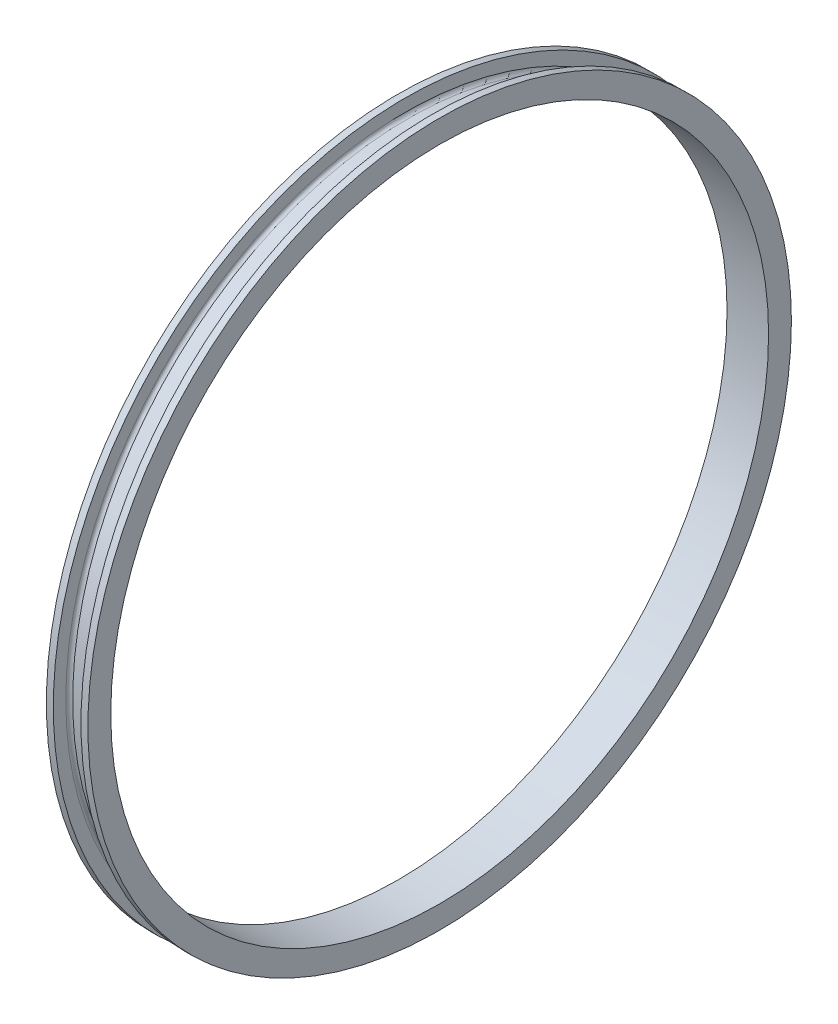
ISO-10303-21;
HEADER;
FILE_DESCRIPTION(('STEP AP214'),'2;1');
FILE_NAME('part.step','',(''),(''),'','','');
FILE_SCHEMA(('AUTOMOTIVE_DESIGN { 1 0 10303 214 1 1 1 1 }'));
ENDSEC;
DATA;
#1=APPLICATION_CONTEXT('core data for automotive mechanical design processes');
#2=APPLICATION_PROTOCOL_DEFINITION('international standard','automotive_design',2000,#1);
#3=PRODUCT_CONTEXT('',#1,'mechanical');
#4=PRODUCT('Part','Part','',(#3));
#5=PRODUCT_RELATED_PRODUCT_CATEGORY('part','',(#4));
#6=PRODUCT_DEFINITION_FORMATION('','',#4);
#7=PRODUCT_DEFINITION_CONTEXT('part definition',#1,'design');
#8=PRODUCT_DEFINITION('design','',#6,#7);
#9=PRODUCT_DEFINITION_SHAPE('','',#8);
#10=(LENGTH_UNIT() NAMED_UNIT(*) SI_UNIT(.MILLI.,.METRE.));
#11=(NAMED_UNIT(*) PLANE_ANGLE_UNIT() SI_UNIT($,.RADIAN.));
#12=(NAMED_UNIT(*) SI_UNIT($,.STERADIAN.) SOLID_ANGLE_UNIT());
#13=UNCERTAINTY_MEASURE_WITH_UNIT(LENGTH_MEASURE(1.E-05),#10,'distance_accuracy_value','');
#14=(GEOMETRIC_REPRESENTATION_CONTEXT(3) GLOBAL_UNCERTAINTY_ASSIGNED_CONTEXT((#13)) GLOBAL_UNIT_ASSIGNED_CONTEXT((#10,
#11,#12)) REPRESENTATION_CONTEXT('',''));
#15=CARTESIAN_POINT('',(0.,0.,0.));
#16=DIRECTION('',(0.,0.,1.));
#17=DIRECTION('',(1.,0.,0.));
#18=AXIS2_PLACEMENT_3D('',#15,#16,#17);
#19=CARTESIAN_POINT('',(0.,0.,0.));
#20=DIRECTION('',(1.,0.,0.));
#21=DIRECTION('',(0.,0.,-1.));
#22=AXIS2_PLACEMENT_3D('',#19,#20,#21);
#23=CYLINDRICAL_SURFACE('',#22,50.8);
#24=CARTESIAN_POINT('',(-75.8170233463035,0.,0.));
#25=DIRECTION('',(1.,0.,0.));
#26=DIRECTION('',(0.,0.,-1.));
#27=AXIS2_PLACEMENT_3D('',#24,#25,#26);
#28=CIRCLE('',#27,50.8);
#29=CARTESIAN_POINT('',(-75.8170233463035,0.,-50.8));
#30=VERTEX_POINT('',#29);
#31=EDGE_CURVE('E64',#30,#30,#28,.T.);
#32=ORIENTED_EDGE('',*,*,#31,.T.);
#33=EDGE_LOOP('',(#32));
#34=FACE_BOUND('',#33,.T.);
#35=CARTESIAN_POINT('',(-74.8170233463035,0.,0.));
#36=DIRECTION('',(1.,0.,0.));
#37=DIRECTION('',(0.,0.,-1.));
#38=AXIS2_PLACEMENT_3D('',#35,#36,#37);
#39=CIRCLE('',#38,50.8);
#40=CARTESIAN_POINT('',(-74.8170233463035,0.,-50.8));
#41=VERTEX_POINT('',#40);
#42=EDGE_CURVE('E10',#41,#41,#39,.T.);
#43=ORIENTED_EDGE('',*,*,#42,.F.);
#44=EDGE_LOOP('',(#43));
#45=FACE_BOUND('',#44,.T.);
#46=ADVANCED_FACE('F30',(#34,#45),#23,.T.);
#47=CARTESIAN_POINT('',(-74.8170233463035,49.,0.));
#48=DIRECTION('',(1.,0.,0.));
#49=DIRECTION('',(0.,0.,-1.));
#50=AXIS2_PLACEMENT_3D('',#47,#48,#49);
#51=PLANE('',#50);
#52=ORIENTED_EDGE('',*,*,#42,.T.);
#53=EDGE_LOOP('',(#52));
#54=FACE_BOUND('',#53,.T.);
#55=CARTESIAN_POINT('',(-74.8170233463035,0.,0.));
#56=DIRECTION('',(1.,0.,0.));
#57=DIRECTION('',(0.,0.,-1.));
#58=AXIS2_PLACEMENT_3D('',#55,#56,#57);
#59=CIRCLE('',#58,49.);
#60=CARTESIAN_POINT('',(-74.8170233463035,0.,-49.));
#61=VERTEX_POINT('',#60);
#62=EDGE_CURVE('E36',#61,#61,#59,.T.);
#63=ORIENTED_EDGE('',*,*,#62,.F.);
#64=EDGE_LOOP('',(#63));
#65=FACE_BOUND('',#64,.T.);
#66=ADVANCED_FACE('F82',(#54,#65),#51,.T.);
#67=CARTESIAN_POINT('',(-74.3170233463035,0.,0.));
#68=DIRECTION('',(1.,0.,0.));
#69=DIRECTION('',(0.,0.,-1.));
#70=AXIS2_PLACEMENT_3D('',#67,#68,#69);
#71=TOROIDAL_SURFACE('',#70,49.,0.500000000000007);
#72=ORIENTED_EDGE('',*,*,#62,.T.);
#73=EDGE_LOOP('',(#72));
#74=FACE_BOUND('',#73,.T.);
#75=CARTESIAN_POINT('',(-74.3170233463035,0.,0.));
#76=DIRECTION('',(1.,0.,0.));
#77=DIRECTION('',(0.,0.,-1.));
#78=AXIS2_PLACEMENT_3D('',#75,#76,#77);
#79=CIRCLE('',#78,48.5);
#80=CARTESIAN_POINT('',(-74.3170233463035,0.,-48.5));
#81=VERTEX_POINT('',#80);
#82=EDGE_CURVE('E40',#81,#81,#79,.T.);
#83=ORIENTED_EDGE('',*,*,#82,.F.);
#84=EDGE_LOOP('',(#83));
#85=FACE_BOUND('',#84,.T.);
#86=ADVANCED_FACE('F86',(#74,#85),#71,.F.);
#87=CARTESIAN_POINT('',(0.,0.,0.));
#88=DIRECTION('',(1.,0.,0.));
#89=DIRECTION('',(0.,0.,-1.));
#90=AXIS2_PLACEMENT_3D('',#87,#88,#89);
#91=CYLINDRICAL_SURFACE('',#90,48.5);
#92=ORIENTED_EDGE('',*,*,#82,.T.);
#93=EDGE_LOOP('',(#92));
#94=FACE_BOUND('',#93,.T.);
#95=CARTESIAN_POINT('',(-71.3170233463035,0.,0.));
#96=DIRECTION('',(1.,0.,0.));
#97=DIRECTION('',(0.,0.,-1.));
#98=AXIS2_PLACEMENT_3D('',#95,#96,#97);
#99=CIRCLE('',#98,48.5);
#100=CARTESIAN_POINT('',(-71.3170233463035,0.,-48.5));
#101=VERTEX_POINT('',#100);
#102=EDGE_CURVE('E44',#101,#101,#99,.T.);
#103=ORIENTED_EDGE('',*,*,#102,.F.);
#104=EDGE_LOOP('',(#103));
#105=FACE_BOUND('',#104,.T.);
#106=ADVANCED_FACE('F90',(#94,#105),#91,.T.);
#107=CARTESIAN_POINT('',(-71.3170233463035,0.,0.));
#108=DIRECTION('',(1.,0.,0.));
#109=DIRECTION('',(0.,0.,-1.));
#110=AXIS2_PLACEMENT_3D('',#107,#108,#109);
#111=TOROIDAL_SURFACE('',#110,49.,0.500000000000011);
#112=ORIENTED_EDGE('',*,*,#102,.T.);
#113=EDGE_LOOP('',(#112));
#114=FACE_BOUND('',#113,.T.);
#115=CARTESIAN_POINT('',(-70.8170233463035,0.,0.));
#116=DIRECTION('',(1.,0.,0.));
#117=DIRECTION('',(0.,0.,-1.));
#118=AXIS2_PLACEMENT_3D('',#115,#116,#117);
#119=CIRCLE('',#118,49.);
#120=CARTESIAN_POINT('',(-70.8170233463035,0.,-49.));
#121=VERTEX_POINT('',#120);
#122=EDGE_CURVE('E49',#121,#121,#119,.T.);
#123=ORIENTED_EDGE('',*,*,#122,.F.);
#124=EDGE_LOOP('',(#123));
#125=FACE_BOUND('',#124,.T.);
#126=ADVANCED_FACE('F96',(#114,#125),#111,.F.);
#127=CARTESIAN_POINT('',(-70.8170233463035,50.8,0.));
#128=DIRECTION('',(-1.,0.,0.));
#129=DIRECTION('',(0.,0.,1.));
#130=AXIS2_PLACEMENT_3D('',#127,#128,#129);
#131=PLANE('',#130);
#132=ORIENTED_EDGE('',*,*,#122,.T.);
#133=EDGE_LOOP('',(#132));
#134=FACE_BOUND('',#133,.T.);
#135=CARTESIAN_POINT('',(-70.8170233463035,0.,0.));
#136=DIRECTION('',(1.,0.,0.));
#137=DIRECTION('',(0.,0.,-1.));
#138=AXIS2_PLACEMENT_3D('',#135,#136,#137);
#139=CIRCLE('',#138,50.8);
#140=CARTESIAN_POINT('',(-70.8170233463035,0.,-50.8));
#141=VERTEX_POINT('',#140);
#142=EDGE_CURVE('E52',#141,#141,#139,.T.);
#143=ORIENTED_EDGE('',*,*,#142,.F.);
#144=EDGE_LOOP('',(#143));
#145=FACE_BOUND('',#144,.T.);
#146=ADVANCED_FACE('F100',(#134,#145),#131,.T.);
#147=CARTESIAN_POINT('',(0.,0.,0.));
#148=DIRECTION('',(1.,0.,0.));
#149=DIRECTION('',(0.,0.,-1.));
#150=AXIS2_PLACEMENT_3D('',#147,#148,#149);
#151=CYLINDRICAL_SURFACE('',#150,50.8);
#152=ORIENTED_EDGE('',*,*,#142,.T.);
#153=EDGE_LOOP('',(#152));
#154=FACE_BOUND('',#153,.T.);
#155=CARTESIAN_POINT('',(-69.8170233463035,0.,0.));
#156=DIRECTION('',(1.,0.,0.));
#157=DIRECTION('',(0.,0.,-1.));
#158=AXIS2_PLACEMENT_3D('',#155,#156,#157);
#159=CIRCLE('',#158,50.8);
#160=CARTESIAN_POINT('',(-69.8170233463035,0.,-50.8));
#161=VERTEX_POINT('',#160);
#162=EDGE_CURVE('E55',#161,#161,#159,.T.);
#163=ORIENTED_EDGE('',*,*,#162,.F.);
#164=EDGE_LOOP('',(#163));
#165=FACE_BOUND('',#164,.T.);
#166=ADVANCED_FACE('F104',(#154,#165),#151,.T.);
#167=CARTESIAN_POINT('',(-69.8170233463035,47.5,0.));
#168=DIRECTION('',(1.,0.,0.));
#169=DIRECTION('',(0.,0.,-1.));
#170=AXIS2_PLACEMENT_3D('',#167,#168,#169);
#171=PLANE('',#170);
#172=ORIENTED_EDGE('',*,*,#162,.T.);
#173=EDGE_LOOP('',(#172));
#174=FACE_BOUND('',#173,.T.);
#175=CARTESIAN_POINT('',(-69.8170233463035,0.,0.));
#176=DIRECTION('',(1.,0.,0.));
#177=DIRECTION('',(0.,0.,-1.));
#178=AXIS2_PLACEMENT_3D('',#175,#176,#177);
#179=CIRCLE('',#178,47.5);
#180=CARTESIAN_POINT('',(-69.8170233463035,0.,-47.5));
#181=VERTEX_POINT('',#180);
#182=EDGE_CURVE('E58',#181,#181,#179,.T.);
#183=ORIENTED_EDGE('',*,*,#182,.F.);
#184=EDGE_LOOP('',(#183));
#185=FACE_BOUND('',#184,.T.);
#186=ADVANCED_FACE('F78',(#174,#185),#171,.T.);
#187=CARTESIAN_POINT('',(0.,0.,0.));
#188=DIRECTION('',(1.,0.,0.));
#189=DIRECTION('',(0.,0.,-1.));
#190=AXIS2_PLACEMENT_3D('',#187,#188,#189);
#191=CYLINDRICAL_SURFACE('',#190,47.5);
#192=ORIENTED_EDGE('',*,*,#182,.T.);
#193=EDGE_LOOP('',(#192));
#194=FACE_BOUND('',#193,.T.);
#195=CARTESIAN_POINT('',(-75.8170233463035,0.,0.));
#196=DIRECTION('',(1.,0.,0.));
#197=DIRECTION('',(0.,0.,-1.));
#198=AXIS2_PLACEMENT_3D('',#195,#196,#197);
#199=CIRCLE('',#198,47.5);
#200=CARTESIAN_POINT('',(-75.8170233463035,0.,-47.5));
#201=VERTEX_POINT('',#200);
#202=EDGE_CURVE('E61',#201,#201,#199,.T.);
#203=ORIENTED_EDGE('',*,*,#202,.F.);
#204=EDGE_LOOP('',(#203));
#205=FACE_BOUND('',#204,.T.);
#206=ADVANCED_FACE('F72',(#194,#205),#191,.F.);
#207=CARTESIAN_POINT('',(-75.8170233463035,50.8,0.));
#208=DIRECTION('',(-1.,0.,0.));
#209=DIRECTION('',(0.,0.,1.));
#210=AXIS2_PLACEMENT_3D('',#207,#208,#209);
#211=PLANE('',#210);
#212=ORIENTED_EDGE('',*,*,#202,.T.);
#213=EDGE_LOOP('',(#212));
#214=FACE_BOUND('',#213,.T.);
#215=ORIENTED_EDGE('',*,*,#31,.F.);
#216=EDGE_LOOP('',(#215));
#217=FACE_BOUND('',#216,.T.);
#218=ADVANCED_FACE('F70',(#214,#217),#211,.T.);
#219=CLOSED_SHELL('',(#46,#66,#86,#106,#126,#146,#166,#186,#206,#218));
#220=MANIFOLD_SOLID_BREP('B2',#219);
#221=ADVANCED_BREP_SHAPE_REPRESENTATION('',(#18,#220),#14);
#222=SHAPE_DEFINITION_REPRESENTATION(#9,#221);
ENDSEC;
END-ISO-10303-21;
